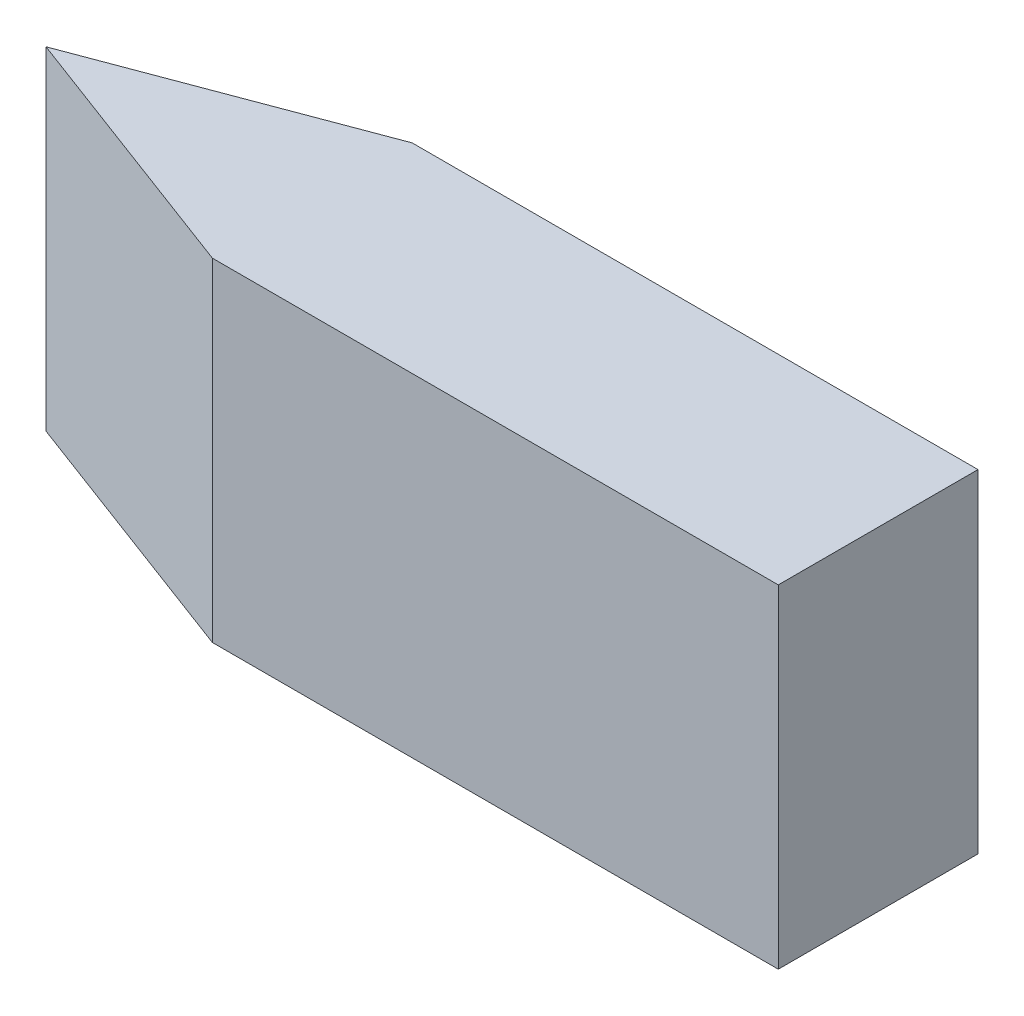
ISO-10303-21;
HEADER;
FILE_DESCRIPTION(('STEP AP214'),'2;1');
FILE_NAME('part.step','',(''),(''),'','','');
FILE_SCHEMA(('AUTOMOTIVE_DESIGN { 1 0 10303 214 1 1 1 1 }'));
ENDSEC;
DATA;
#1=APPLICATION_CONTEXT('core data for automotive mechanical design processes');
#2=APPLICATION_PROTOCOL_DEFINITION('international standard','automotive_design',2000,#1);
#3=PRODUCT_CONTEXT('',#1,'mechanical');
#4=PRODUCT('Part','Part','',(#3));
#5=PRODUCT_RELATED_PRODUCT_CATEGORY('part','',(#4));
#6=PRODUCT_DEFINITION_FORMATION('','',#4);
#7=PRODUCT_DEFINITION_CONTEXT('part definition',#1,'design');
#8=PRODUCT_DEFINITION('design','',#6,#7);
#9=PRODUCT_DEFINITION_SHAPE('','',#8);
#10=(LENGTH_UNIT() NAMED_UNIT(*) SI_UNIT(.MILLI.,.METRE.));
#11=(NAMED_UNIT(*) PLANE_ANGLE_UNIT() SI_UNIT($,.RADIAN.));
#12=(NAMED_UNIT(*) SI_UNIT($,.STERADIAN.) SOLID_ANGLE_UNIT());
#13=UNCERTAINTY_MEASURE_WITH_UNIT(LENGTH_MEASURE(1.E-05),#10,'distance_accuracy_value','');
#14=(GEOMETRIC_REPRESENTATION_CONTEXT(3) GLOBAL_UNCERTAINTY_ASSIGNED_CONTEXT((#13)) GLOBAL_UNIT_ASSIGNED_CONTEXT((#10,
#11,#12)) REPRESENTATION_CONTEXT('',''));
#15=CARTESIAN_POINT('',(0.,0.,0.));
#16=DIRECTION('',(0.,0.,1.));
#17=DIRECTION('',(1.,0.,0.));
#18=AXIS2_PLACEMENT_3D('',#15,#16,#17);
#19=CARTESIAN_POINT('',(0.,10.,0.));
#20=DIRECTION('',(-1.,0.,0.));
#21=DIRECTION('',(0.,0.,1.));
#22=AXIS2_PLACEMENT_3D('',#19,#20,#21);
#23=PLANE('',#22);
#24=DIRECTION('',(0.,0.,-1.));
#25=VECTOR('',#24,1.);
#26=CARTESIAN_POINT('',(0.,0.,0.));
#27=LINE('',#26,#25);
#28=CARTESIAN_POINT('',(0.,0.,0.));
#29=VERTEX_POINT('',#28);
#30=CARTESIAN_POINT('',(0.,0.,-6.));
#31=VERTEX_POINT('',#30);
#32=EDGE_CURVE('E105',#29,#31,#27,.T.);
#33=ORIENTED_EDGE('',*,*,#32,.T.);
#34=DIRECTION('',(0.,-1.,0.));
#35=VECTOR('',#34,1.);
#36=CARTESIAN_POINT('',(0.,10.,-6.));
#37=LINE('',#36,#35);
#38=CARTESIAN_POINT('',(0.,10.,-6.));
#39=VERTEX_POINT('',#38);
#40=EDGE_CURVE('E11',#39,#31,#37,.T.);
#41=ORIENTED_EDGE('',*,*,#40,.F.);
#42=DIRECTION('',(0.,0.,-1.));
#43=VECTOR('',#42,1.);
#44=CARTESIAN_POINT('',(0.,10.,0.));
#45=LINE('',#44,#43);
#46=CARTESIAN_POINT('',(0.,10.,0.));
#47=VERTEX_POINT('',#46);
#48=EDGE_CURVE('E113',#47,#39,#45,.T.);
#49=ORIENTED_EDGE('',*,*,#48,.F.);
#50=DIRECTION('',(0.,-1.,0.));
#51=VECTOR('',#50,1.);
#52=CARTESIAN_POINT('',(0.,10.,0.));
#53=LINE('',#52,#51);
#54=EDGE_CURVE('E101',#47,#29,#53,.T.);
#55=ORIENTED_EDGE('',*,*,#54,.T.);
#56=EDGE_LOOP('',(#33,#41,#49,#55));
#57=FACE_BOUND('',#56,.T.);
#58=ADVANCED_FACE('F31',(#57),#23,.F.);
#59=CARTESIAN_POINT('',(0.,10.,-6.));
#60=DIRECTION('',(0.,0.,1.));
#61=DIRECTION('',(1.,0.,0.));
#62=AXIS2_PLACEMENT_3D('',#59,#60,#61);
#63=PLANE('',#62);
#64=DIRECTION('',(-1.,0.,0.));
#65=VECTOR('',#64,1.);
#66=CARTESIAN_POINT('',(0.,0.,-6.));
#67=LINE('',#66,#65);
#68=CARTESIAN_POINT('',(-17.,0.,-6.));
#69=VERTEX_POINT('',#68);
#70=EDGE_CURVE('E108',#31,#69,#67,.T.);
#71=ORIENTED_EDGE('',*,*,#70,.T.);
#72=DIRECTION('',(0.,-1.,0.));
#73=VECTOR('',#72,1.);
#74=CARTESIAN_POINT('',(-17.,10.,-6.));
#75=LINE('',#74,#73);
#76=CARTESIAN_POINT('',(-17.,10.,-6.));
#77=VERTEX_POINT('',#76);
#78=EDGE_CURVE('E39',#77,#69,#75,.T.);
#79=ORIENTED_EDGE('',*,*,#78,.F.);
#80=DIRECTION('',(-1.,0.,0.));
#81=VECTOR('',#80,1.);
#82=CARTESIAN_POINT('',(0.,10.,-6.));
#83=LINE('',#82,#81);
#84=EDGE_CURVE('E81',#39,#77,#83,.T.);
#85=ORIENTED_EDGE('',*,*,#84,.F.);
#86=ORIENTED_EDGE('',*,*,#40,.T.);
#87=EDGE_LOOP('',(#71,#79,#85,#86));
#88=FACE_BOUND('',#87,.T.);
#89=ADVANCED_FACE('F132',(#88),#63,.F.);
#90=CARTESIAN_POINT('',(-17.,10.,-6.));
#91=DIRECTION('',(0.351123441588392,0.,0.936329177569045));
#92=DIRECTION('',(0.936329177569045,0.,-0.351123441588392));
#93=AXIS2_PLACEMENT_3D('',#90,#91,#92);
#94=PLANE('',#93);
#95=DIRECTION('',(-0.936329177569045,0.,0.351123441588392));
#96=VECTOR('',#95,1.);
#97=CARTESIAN_POINT('',(-17.,0.,-6.));
#98=LINE('',#97,#96);
#99=CARTESIAN_POINT('',(-25.,0.,-3.));
#100=VERTEX_POINT('',#99);
#101=EDGE_CURVE('E96',#69,#100,#98,.T.);
#102=ORIENTED_EDGE('',*,*,#101,.T.);
#103=DIRECTION('',(0.,-1.,0.));
#104=VECTOR('',#103,1.);
#105=CARTESIAN_POINT('',(-25.,10.,-3.));
#106=LINE('',#105,#104);
#107=CARTESIAN_POINT('',(-25.,10.,-3.));
#108=VERTEX_POINT('',#107);
#109=EDGE_CURVE('E93',#108,#100,#106,.T.);
#110=ORIENTED_EDGE('',*,*,#109,.F.);
#111=DIRECTION('',(-0.936329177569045,0.,0.351123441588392));
#112=VECTOR('',#111,1.);
#113=CARTESIAN_POINT('',(-17.,10.,-6.));
#114=LINE('',#113,#112);
#115=EDGE_CURVE('E85',#77,#108,#114,.T.);
#116=ORIENTED_EDGE('',*,*,#115,.F.);
#117=ORIENTED_EDGE('',*,*,#78,.T.);
#118=EDGE_LOOP('',(#102,#110,#116,#117));
#119=FACE_BOUND('',#118,.T.);
#120=ADVANCED_FACE('F94',(#119),#94,.F.);
#121=CARTESIAN_POINT('',(-25.,10.,-3.));
#122=DIRECTION('',(0.351123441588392,0.,-0.936329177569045));
#123=DIRECTION('',(-0.936329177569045,0.,-0.351123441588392));
#124=AXIS2_PLACEMENT_3D('',#121,#122,#123);
#125=PLANE('',#124);
#126=DIRECTION('',(0.936329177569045,0.,0.351123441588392));
#127=VECTOR('',#126,1.);
#128=CARTESIAN_POINT('',(-25.,0.,-3.));
#129=LINE('',#128,#127);
#130=CARTESIAN_POINT('',(-17.,0.,0.));
#131=VERTEX_POINT('',#130);
#132=EDGE_CURVE('E67',#100,#131,#129,.T.);
#133=ORIENTED_EDGE('',*,*,#132,.T.);
#134=DIRECTION('',(0.,-1.,0.));
#135=VECTOR('',#134,1.);
#136=CARTESIAN_POINT('',(-17.,10.,0.));
#137=LINE('',#136,#135);
#138=CARTESIAN_POINT('',(-17.,10.,0.));
#139=VERTEX_POINT('',#138);
#140=EDGE_CURVE('E97',#139,#131,#137,.T.);
#141=ORIENTED_EDGE('',*,*,#140,.F.);
#142=DIRECTION('',(0.936329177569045,0.,0.351123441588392));
#143=VECTOR('',#142,1.);
#144=CARTESIAN_POINT('',(-25.,10.,-3.));
#145=LINE('',#144,#143);
#146=EDGE_CURVE('E89',#108,#139,#145,.T.);
#147=ORIENTED_EDGE('',*,*,#146,.F.);
#148=ORIENTED_EDGE('',*,*,#109,.T.);
#149=EDGE_LOOP('',(#133,#141,#147,#148));
#150=FACE_BOUND('',#149,.T.);
#151=ADVANCED_FACE('F99',(#150),#125,.F.);
#152=CARTESIAN_POINT('',(0.,10.,0.));
#153=DIRECTION('',(0.,0.,-1.));
#154=DIRECTION('',(-1.,0.,0.));
#155=AXIS2_PLACEMENT_3D('',#152,#153,#154);
#156=PLANE('',#155);
#157=DIRECTION('',(1.,0.,0.));
#158=VECTOR('',#157,1.);
#159=CARTESIAN_POINT('',(0.,0.,0.));
#160=LINE('',#159,#158);
#161=EDGE_CURVE('E73',#131,#29,#160,.T.);
#162=ORIENTED_EDGE('',*,*,#161,.T.);
#163=ORIENTED_EDGE('',*,*,#54,.F.);
#164=DIRECTION('',(1.,0.,0.));
#165=VECTOR('',#164,1.);
#166=CARTESIAN_POINT('',(0.,10.,0.));
#167=LINE('',#166,#165);
#168=EDGE_CURVE('E47',#139,#47,#167,.T.);
#169=ORIENTED_EDGE('',*,*,#168,.F.);
#170=ORIENTED_EDGE('',*,*,#140,.T.);
#171=EDGE_LOOP('',(#162,#163,#169,#170));
#172=FACE_BOUND('',#171,.T.);
#173=ADVANCED_FACE('F121',(#172),#156,.F.);
#174=CARTESIAN_POINT('',(0.,10.,-6.));
#175=DIRECTION('',(0.,1.,0.));
#176=DIRECTION('',(0.,0.,1.));
#177=AXIS2_PLACEMENT_3D('',#174,#175,#176);
#178=PLANE('',#177);
#179=ORIENTED_EDGE('',*,*,#48,.T.);
#180=ORIENTED_EDGE('',*,*,#84,.T.);
#181=ORIENTED_EDGE('',*,*,#115,.T.);
#182=ORIENTED_EDGE('',*,*,#146,.T.);
#183=ORIENTED_EDGE('',*,*,#168,.T.);
#184=EDGE_LOOP('',(#179,#180,#181,#182,#183));
#185=FACE_BOUND('',#184,.T.);
#186=ADVANCED_FACE('F87',(#185),#178,.T.);
#187=CARTESIAN_POINT('',(0.,0.,-6.));
#188=DIRECTION('',(0.,1.,0.));
#189=DIRECTION('',(0.,0.,1.));
#190=AXIS2_PLACEMENT_3D('',#187,#188,#189);
#191=PLANE('',#190);
#192=ORIENTED_EDGE('',*,*,#32,.F.);
#193=ORIENTED_EDGE('',*,*,#161,.F.);
#194=ORIENTED_EDGE('',*,*,#132,.F.);
#195=ORIENTED_EDGE('',*,*,#101,.F.);
#196=ORIENTED_EDGE('',*,*,#70,.F.);
#197=EDGE_LOOP('',(#192,#193,#194,#195,#196));
#198=FACE_BOUND('',#197,.T.);
#199=ADVANCED_FACE('F117',(#198),#191,.F.);
#200=CLOSED_SHELL('',(#58,#89,#120,#151,#173,#186,#199));
#201=MANIFOLD_SOLID_BREP('B2',#200);
#202=ADVANCED_BREP_SHAPE_REPRESENTATION('',(#18,#201),#14);
#203=SHAPE_DEFINITION_REPRESENTATION(#9,#202);
ENDSEC;
END-ISO-10303-21;
